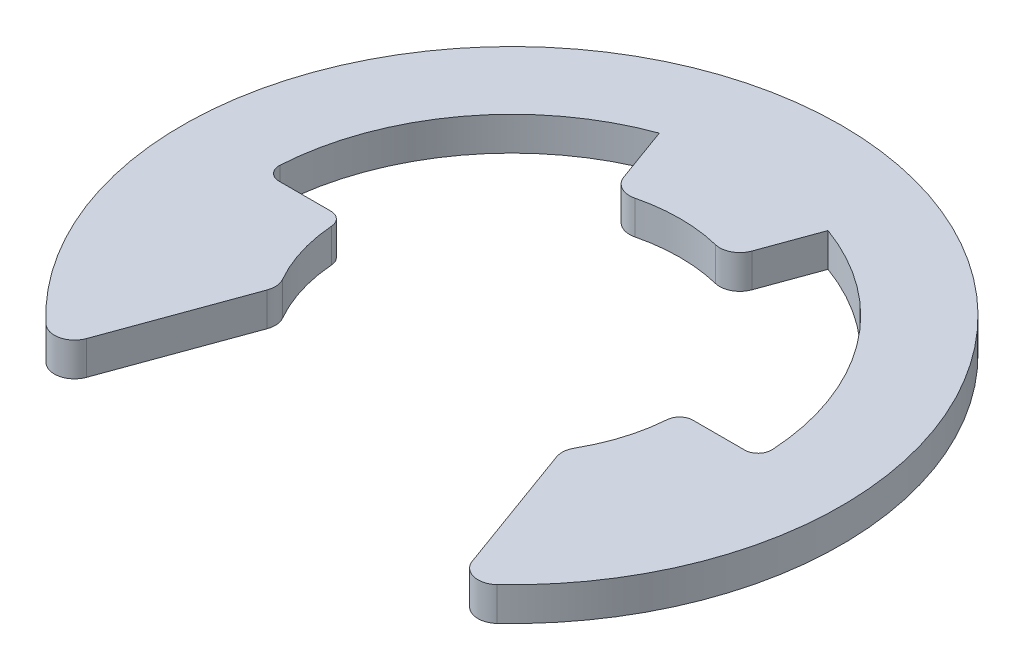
ISO-10303-21;
HEADER;
FILE_DESCRIPTION(('STEP AP214'),'2;1');
FILE_NAME('part.step','',(''),(''),'','','');
FILE_SCHEMA(('AUTOMOTIVE_DESIGN { 1 0 10303 214 1 1 1 1 }'));
ENDSEC;
DATA;
#1=APPLICATION_CONTEXT('core data for automotive mechanical design processes');
#2=APPLICATION_PROTOCOL_DEFINITION('international standard','automotive_design',2000,#1);
#3=PRODUCT_CONTEXT('',#1,'mechanical');
#4=PRODUCT('Part','Part','',(#3));
#5=PRODUCT_RELATED_PRODUCT_CATEGORY('part','',(#4));
#6=PRODUCT_DEFINITION_FORMATION('','',#4);
#7=PRODUCT_DEFINITION_CONTEXT('part definition',#1,'design');
#8=PRODUCT_DEFINITION('design','',#6,#7);
#9=PRODUCT_DEFINITION_SHAPE('','',#8);
#10=(LENGTH_UNIT() NAMED_UNIT(*) SI_UNIT(.MILLI.,.METRE.));
#11=(NAMED_UNIT(*) PLANE_ANGLE_UNIT() SI_UNIT($,.RADIAN.));
#12=(NAMED_UNIT(*) SI_UNIT($,.STERADIAN.) SOLID_ANGLE_UNIT());
#13=UNCERTAINTY_MEASURE_WITH_UNIT(LENGTH_MEASURE(1.E-05),#10,'distance_accuracy_value','');
#14=(GEOMETRIC_REPRESENTATION_CONTEXT(3) GLOBAL_UNCERTAINTY_ASSIGNED_CONTEXT((#13)) GLOBAL_UNIT_ASSIGNED_CONTEXT((#10,
#11,#12)) REPRESENTATION_CONTEXT('',''));
#15=CARTESIAN_POINT('',(0.,0.,0.));
#16=DIRECTION('',(0.,0.,1.));
#17=DIRECTION('',(1.,0.,0.));
#18=AXIS2_PLACEMENT_3D('',#15,#16,#17);
#19=CARTESIAN_POINT('',(0.,0.75,0.));
#20=DIRECTION('',(0.,-1.,0.));
#21=DIRECTION('',(0.,0.,-1.));
#22=AXIS2_PLACEMENT_3D('',#19,#20,#21);
#23=CYLINDRICAL_SURFACE('',#22,11.);
#24=CARTESIAN_POINT('',(0.,0.75,0.));
#25=DIRECTION('',(0.,-1.,0.));
#26=DIRECTION('',(0.,0.,1.));
#27=AXIS2_PLACEMENT_3D('',#24,#25,#26);
#28=CIRCLE('',#27,11.);
#29=CARTESIAN_POINT('',(-10.9816785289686,0.75,-0.634615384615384));
#30=VERTEX_POINT('',#29);
#31=CARTESIAN_POINT('',(-3.76222157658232,0.75,-10.336618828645));
#32=VERTEX_POINT('',#31);
#33=EDGE_CURVE('E187',#30,#32,#28,.T.);
#34=ORIENTED_EDGE('',*,*,#33,.F.);
#35=DIRECTION('',(0.,-1.,0.));
#36=VECTOR('',#35,1.);
#37=CARTESIAN_POINT('',(-10.9816785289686,0.75,-0.634615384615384));
#38=LINE('',#37,#36);
#39=CARTESIAN_POINT('',(-10.9816785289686,-0.75,-0.634615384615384));
#40=VERTEX_POINT('',#39);
#41=EDGE_CURVE('E328',#30,#40,#38,.T.);
#42=ORIENTED_EDGE('',*,*,#41,.T.);
#43=CARTESIAN_POINT('',(0.,-0.75,0.));
#44=DIRECTION('',(0.,-1.,0.));
#45=DIRECTION('',(0.,0.,1.));
#46=AXIS2_PLACEMENT_3D('',#43,#44,#45);
#47=CIRCLE('',#46,11.);
#48=CARTESIAN_POINT('',(-3.76222157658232,-0.75,-10.336618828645));
#49=VERTEX_POINT('',#48);
#50=EDGE_CURVE('E211',#40,#49,#47,.T.);
#51=ORIENTED_EDGE('',*,*,#50,.T.);
#52=DIRECTION('',(0.,-1.,0.));
#53=VECTOR('',#52,1.);
#54=CARTESIAN_POINT('',(-3.76222157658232,0.75,-10.336618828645));
#55=LINE('',#54,#53);
#56=EDGE_CURVE('E204',#32,#49,#55,.T.);
#57=ORIENTED_EDGE('',*,*,#56,.F.);
#58=EDGE_LOOP('',(#34,#42,#51,#57));
#59=FACE_BOUND('',#58,.T.);
#60=ADVANCED_FACE('F39',(#59),#23,.F.);
#61=CARTESIAN_POINT('',(-3.76222157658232,0.75,-10.336618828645));
#62=DIRECTION('',(0.939692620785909,0.,-0.342020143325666));
#63=DIRECTION('',(-0.342020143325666,0.,-0.939692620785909));
#64=AXIS2_PLACEMENT_3D('',#61,#62,#63);
#65=PLANE('',#64);
#66=DIRECTION('',(0.342020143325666,0.,0.939692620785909));
#67=VECTOR('',#66,1.);
#68=CARTESIAN_POINT('',(-3.76222157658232,-0.75,-10.336618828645));
#69=LINE('',#68,#67);
#70=CARTESIAN_POINT('',(-2.85643134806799,-0.75,-7.8479806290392));
#71=VERTEX_POINT('',#70);
#72=EDGE_CURVE('E449',#49,#71,#69,.T.);
#73=ORIENTED_EDGE('',*,*,#72,.T.);
#74=DIRECTION('',(0.,-1.,0.));
#75=VECTOR('',#74,1.);
#76=CARTESIAN_POINT('',(-2.85643134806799,0.75,-7.8479806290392));
#77=LINE('',#76,#75);
#78=CARTESIAN_POINT('',(-2.85643134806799,0.75,-7.8479806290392));
#79=VERTEX_POINT('',#78);
#80=EDGE_CURVE('E206',#71,#79,#77,.F.);
#81=ORIENTED_EDGE('',*,*,#80,.T.);
#82=DIRECTION('',(0.342020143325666,0.,0.939692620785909));
#83=VECTOR('',#82,1.);
#84=CARTESIAN_POINT('',(-3.76222157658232,0.75,-10.336618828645));
#85=LINE('',#84,#83);
#86=EDGE_CURVE('E191',#32,#79,#85,.T.);
#87=ORIENTED_EDGE('',*,*,#86,.F.);
#88=ORIENTED_EDGE('',*,*,#56,.T.);
#89=EDGE_LOOP('',(#73,#81,#87,#88));
#90=FACE_BOUND('',#89,.T.);
#91=ADVANCED_FACE('F203',(#90),#65,.F.);
#92=CARTESIAN_POINT('',(0.,0.75,0.));
#93=DIRECTION('',(0.,-1.,0.));
#94=DIRECTION('',(0.,0.,-1.));
#95=AXIS2_PLACEMENT_3D('',#92,#93,#94);
#96=CYLINDRICAL_SURFACE('',#95,7.5);
#97=CARTESIAN_POINT('',(0.,-0.75,0.));
#98=DIRECTION('',(0.,-1.,0.));
#99=DIRECTION('',(0.,0.,1.));
#100=AXIS2_PLACEMENT_3D('',#97,#98,#99);
#101=CIRCLE('',#100,7.5);
#102=CARTESIAN_POINT('',(-1.7952749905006,-0.75,-7.28196317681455));
#103=VERTEX_POINT('',#102);
#104=CARTESIAN_POINT('',(1.7952749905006,-0.75,-7.28196317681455));
#105=VERTEX_POINT('',#104);
#106=EDGE_CURVE('E451',#103,#105,#101,.T.);
#107=ORIENTED_EDGE('',*,*,#106,.T.);
#108=DIRECTION('',(0.,-1.,0.));
#109=VECTOR('',#108,1.);
#110=CARTESIAN_POINT('',(1.7952749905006,0.75,-7.28196317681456));
#111=LINE('',#110,#109);
#112=CARTESIAN_POINT('',(1.7952749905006,0.75,-7.28196317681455));
#113=VERTEX_POINT('',#112);
#114=EDGE_CURVE('E290',#105,#113,#111,.F.);
#115=ORIENTED_EDGE('',*,*,#114,.T.);
#116=CARTESIAN_POINT('',(0.,0.75,0.));
#117=DIRECTION('',(0.,-1.,0.));
#118=DIRECTION('',(0.,0.,1.));
#119=AXIS2_PLACEMENT_3D('',#116,#117,#118);
#120=CIRCLE('',#119,7.5);
#121=CARTESIAN_POINT('',(-1.7952749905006,0.75,-7.28196317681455));
#122=VERTEX_POINT('',#121);
#123=EDGE_CURVE('E208',#122,#113,#120,.T.);
#124=ORIENTED_EDGE('',*,*,#123,.F.);
#125=DIRECTION('',(0.,-1.,0.));
#126=VECTOR('',#125,1.);
#127=CARTESIAN_POINT('',(-1.7952749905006,0.75,-7.28196317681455));
#128=LINE('',#127,#126);
#129=EDGE_CURVE('E286',#122,#103,#128,.T.);
#130=ORIENTED_EDGE('',*,*,#129,.T.);
#131=EDGE_LOOP('',(#107,#115,#124,#130));
#132=FACE_BOUND('',#131,.T.);
#133=ADVANCED_FACE('F372',(#132),#96,.F.);
#134=CARTESIAN_POINT('',(2.56515107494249,0.75,-7.04769465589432));
#135=DIRECTION('',(-0.93969262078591,0.,-0.342020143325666));
#136=DIRECTION('',(-0.342020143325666,0.,0.93969262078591));
#137=AXIS2_PLACEMENT_3D('',#134,#135,#136);
#138=PLANE('',#137);
#139=DIRECTION('',(0.342020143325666,0.,-0.93969262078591));
#140=VECTOR('',#139,1.);
#141=CARTESIAN_POINT('',(2.56515107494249,0.75,-7.04769465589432));
#142=LINE('',#141,#140);
#143=CARTESIAN_POINT('',(2.85643134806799,0.75,-7.8479806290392));
#144=VERTEX_POINT('',#143);
#145=CARTESIAN_POINT('',(3.76222157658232,0.75,-10.336618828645));
#146=VERTEX_POINT('',#145);
#147=EDGE_CURVE('E426',#144,#146,#142,.T.);
#148=ORIENTED_EDGE('',*,*,#147,.F.);
#149=DIRECTION('',(0.,-1.,0.));
#150=VECTOR('',#149,1.);
#151=CARTESIAN_POINT('',(2.85643134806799,0.75,-7.8479806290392));
#152=LINE('',#151,#150);
#153=CARTESIAN_POINT('',(2.85643134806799,-0.75,-7.8479806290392));
#154=VERTEX_POINT('',#153);
#155=EDGE_CURVE('E282',#144,#154,#152,.T.);
#156=ORIENTED_EDGE('',*,*,#155,.T.);
#157=DIRECTION('',(0.342020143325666,0.,-0.93969262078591));
#158=VECTOR('',#157,1.);
#159=CARTESIAN_POINT('',(2.56515107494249,-0.75,-7.04769465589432));
#160=LINE('',#159,#158);
#161=CARTESIAN_POINT('',(3.76222157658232,-0.75,-10.336618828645));
#162=VERTEX_POINT('',#161);
#163=EDGE_CURVE('E454',#154,#162,#160,.T.);
#164=ORIENTED_EDGE('',*,*,#163,.T.);
#165=DIRECTION('',(0.,-1.,0.));
#166=VECTOR('',#165,1.);
#167=CARTESIAN_POINT('',(3.76222157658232,0.75,-10.336618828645));
#168=LINE('',#167,#166);
#169=EDGE_CURVE('E215',#146,#162,#168,.T.);
#170=ORIENTED_EDGE('',*,*,#169,.F.);
#171=EDGE_LOOP('',(#148,#156,#164,#170));
#172=FACE_BOUND('',#171,.T.);
#173=ADVANCED_FACE('F528',(#172),#138,.F.);
#174=CARTESIAN_POINT('',(0.,0.75,0.));
#175=DIRECTION('',(0.,-1.,0.));
#176=DIRECTION('',(0.,0.,-1.));
#177=AXIS2_PLACEMENT_3D('',#174,#175,#176);
#178=CYLINDRICAL_SURFACE('',#177,11.);
#179=CARTESIAN_POINT('',(0.,-0.75,0.));
#180=DIRECTION('',(0.,-1.,0.));
#181=DIRECTION('',(0.,0.,1.));
#182=AXIS2_PLACEMENT_3D('',#179,#180,#181);
#183=CIRCLE('',#182,11.);
#184=CARTESIAN_POINT('',(10.9816785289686,-0.75,-0.634615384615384));
#185=VERTEX_POINT('',#184);
#186=EDGE_CURVE('E457',#162,#185,#183,.T.);
#187=ORIENTED_EDGE('',*,*,#186,.T.);
#188=DIRECTION('',(0.,-1.,0.));
#189=VECTOR('',#188,1.);
#190=CARTESIAN_POINT('',(10.9816785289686,0.75,-0.634615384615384));
#191=LINE('',#190,#189);
#192=CARTESIAN_POINT('',(10.9816785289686,0.75,-0.634615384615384));
#193=VERTEX_POINT('',#192);
#194=EDGE_CURVE('E309',#185,#193,#191,.F.);
#195=ORIENTED_EDGE('',*,*,#194,.T.);
#196=CARTESIAN_POINT('',(0.,0.75,0.));
#197=DIRECTION('',(0.,-1.,0.));
#198=DIRECTION('',(0.,0.,1.));
#199=AXIS2_PLACEMENT_3D('',#196,#197,#198);
#200=CIRCLE('',#199,11.);
#201=EDGE_CURVE('E412',#146,#193,#200,.T.);
#202=ORIENTED_EDGE('',*,*,#201,.F.);
#203=ORIENTED_EDGE('',*,*,#169,.T.);
#204=EDGE_LOOP('',(#187,#195,#202,#203));
#205=FACE_BOUND('',#204,.T.);
#206=ADVANCED_FACE('F522',(#205),#178,.F.);
#207=CARTESIAN_POINT('',(7.5,0.75,0.));
#208=DIRECTION('',(0.,0.,1.));
#209=DIRECTION('',(1.,0.,0.));
#210=AXIS2_PLACEMENT_3D('',#207,#208,#209);
#211=PLANE('',#210);
#212=DIRECTION('',(-1.,0.,0.));
#213=VECTOR('',#212,1.);
#214=CARTESIAN_POINT('',(7.5,0.75,0.));
#215=LINE('',#214,#213);
#216=CARTESIAN_POINT('',(10.3826778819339,0.75,0.));
#217=VERTEX_POINT('',#216);
#218=CARTESIAN_POINT('',(8.07774721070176,0.75,0.));
#219=VERTEX_POINT('',#218);
#220=EDGE_CURVE('E409',#217,#219,#215,.T.);
#221=ORIENTED_EDGE('',*,*,#220,.F.);
#222=DIRECTION('',(0.,1.,0.));
#223=VECTOR('',#222,1.);
#224=CARTESIAN_POINT('',(10.3826778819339,-0.75,0.));
#225=LINE('',#224,#223);
#226=CARTESIAN_POINT('',(10.3826778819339,-0.75,0.));
#227=VERTEX_POINT('',#226);
#228=EDGE_CURVE('E305',#217,#227,#225,.F.);
#229=ORIENTED_EDGE('',*,*,#228,.T.);
#230=DIRECTION('',(-1.,0.,0.));
#231=VECTOR('',#230,1.);
#232=CARTESIAN_POINT('',(7.5,-0.75,0.));
#233=LINE('',#232,#231);
#234=CARTESIAN_POINT('',(8.07774721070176,-0.75,0.));
#235=VERTEX_POINT('',#234);
#236=EDGE_CURVE('E461',#227,#235,#233,.T.);
#237=ORIENTED_EDGE('',*,*,#236,.T.);
#238=DIRECTION('',(0.,-1.,0.));
#239=VECTOR('',#238,1.);
#240=CARTESIAN_POINT('',(8.07774721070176,0.75,0.));
#241=LINE('',#240,#239);
#242=EDGE_CURVE('E302',#235,#219,#241,.F.);
#243=ORIENTED_EDGE('',*,*,#242,.T.);
#244=EDGE_LOOP('',(#221,#229,#237,#243));
#245=FACE_BOUND('',#244,.T.);
#246=ADVANCED_FACE('F414',(#245),#211,.F.);
#247=CARTESIAN_POINT('',(0.,0.75,0.));
#248=DIRECTION('',(0.,-1.,0.));
#249=DIRECTION('',(0.,0.,-1.));
#250=AXIS2_PLACEMENT_3D('',#247,#248,#249);
#251=CYLINDRICAL_SURFACE('',#250,7.5);
#252=CARTESIAN_POINT('',(0.,0.75,0.));
#253=DIRECTION('',(0.,-1.,0.));
#254=DIRECTION('',(0.,0.,1.));
#255=AXIS2_PLACEMENT_3D('',#252,#253,#254);
#256=CIRCLE('',#255,7.5);
#257=CARTESIAN_POINT('',(7.47939556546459,0.75,0.555555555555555));
#258=VERTEX_POINT('',#257);
#259=CARTESIAN_POINT('',(6.5162225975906,0.75,3.71333314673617));
#260=VERTEX_POINT('',#259);
#261=EDGE_CURVE('E419',#258,#260,#256,.T.);
#262=ORIENTED_EDGE('',*,*,#261,.F.);
#263=DIRECTION('',(0.,-1.,0.));
#264=VECTOR('',#263,1.);
#265=CARTESIAN_POINT('',(7.47939556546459,0.75,0.555555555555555));
#266=LINE('',#265,#264);
#267=CARTESIAN_POINT('',(7.47939556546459,-0.75,0.555555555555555));
#268=VERTEX_POINT('',#267);
#269=EDGE_CURVE('E312',#258,#268,#266,.T.);
#270=ORIENTED_EDGE('',*,*,#269,.T.);
#271=CARTESIAN_POINT('',(0.,-0.75,0.));
#272=DIRECTION('',(0.,-1.,0.));
#273=DIRECTION('',(0.,0.,1.));
#274=AXIS2_PLACEMENT_3D('',#271,#272,#273);
#275=CIRCLE('',#274,7.5);
#276=CARTESIAN_POINT('',(6.5162225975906,-0.75,3.71333314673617));
#277=VERTEX_POINT('',#276);
#278=EDGE_CURVE('E464',#268,#277,#275,.T.);
#279=ORIENTED_EDGE('',*,*,#278,.T.);
#280=DIRECTION('',(0.,-1.,0.));
#281=VECTOR('',#280,1.);
#282=CARTESIAN_POINT('',(6.51622259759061,0.75,3.71333314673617));
#283=LINE('',#282,#281);
#284=EDGE_CURVE('E249',#277,#260,#283,.F.);
#285=ORIENTED_EDGE('',*,*,#284,.T.);
#286=EDGE_LOOP('',(#262,#270,#279,#285));
#287=FACE_BOUND('',#286,.T.);
#288=ADVANCED_FACE('F513',(#287),#251,.F.);
#289=CARTESIAN_POINT('',(6.30499999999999,0.75,4.0616468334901));
#290=DIRECTION('',(0.939692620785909,0.,-0.342020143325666));
#291=DIRECTION('',(-0.342020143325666,0.,-0.939692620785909));
#292=AXIS2_PLACEMENT_3D('',#289,#290,#291);
#293=PLANE('',#292);
#294=DIRECTION('',(0.342020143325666,0.,0.939692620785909));
#295=VECTOR('',#294,1.);
#296=CARTESIAN_POINT('',(6.30499999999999,0.75,4.0616468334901));
#297=LINE('',#296,#295);
#298=CARTESIAN_POINT('',(6.45244595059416,0.75,4.46675125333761));
#299=VERTEX_POINT('',#298);
#300=CARTESIAN_POINT('',(8.60039109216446,0.75,10.3681820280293));
#301=VERTEX_POINT('',#300);
#302=EDGE_CURVE('E423',#299,#301,#297,.T.);
#303=ORIENTED_EDGE('',*,*,#302,.F.);
#304=DIRECTION('',(0.,-1.,0.));
#305=VECTOR('',#304,1.);
#306=CARTESIAN_POINT('',(6.45244595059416,0.75,4.46675125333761));
#307=LINE('',#306,#305);
#308=CARTESIAN_POINT('',(6.45244595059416,-0.75,4.46675125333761));
#309=VERTEX_POINT('',#308);
#310=EDGE_CURVE('E220',#299,#309,#307,.T.);
#311=ORIENTED_EDGE('',*,*,#310,.T.);
#312=DIRECTION('',(0.342020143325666,0.,0.939692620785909));
#313=VECTOR('',#312,1.);
#314=CARTESIAN_POINT('',(6.30499999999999,-0.75,4.0616468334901));
#315=LINE('',#314,#313);
#316=CARTESIAN_POINT('',(8.60039109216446,-0.75,10.3681820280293));
#317=VERTEX_POINT('',#316);
#318=EDGE_CURVE('E467',#309,#317,#315,.T.);
#319=ORIENTED_EDGE('',*,*,#318,.T.);
#320=DIRECTION('',(0.,-1.,0.));
#321=VECTOR('',#320,1.);
#322=CARTESIAN_POINT('',(8.60039109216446,0.75,10.3681820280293));
#323=LINE('',#322,#321);
#324=EDGE_CURVE('E214',#317,#301,#323,.F.);
#325=ORIENTED_EDGE('',*,*,#324,.T.);
#326=EDGE_LOOP('',(#303,#311,#319,#325));
#327=FACE_BOUND('',#326,.T.);
#328=ADVANCED_FACE('F507',(#327),#293,.F.);
#329=CARTESIAN_POINT('',(0.,0.75,0.));
#330=DIRECTION('',(0.,-1.,0.));
#331=DIRECTION('',(0.,0.,-1.));
#332=AXIS2_PLACEMENT_3D('',#329,#330,#331);
#333=CYLINDRICAL_SURFACE('',#332,14.7);
#334=CARTESIAN_POINT('',(0.,0.75,0.));
#335=DIRECTION('',(0.,1.,0.));
#336=DIRECTION('',(0.,0.,1.));
#337=AXIS2_PLACEMENT_3D('',#334,#335,#336);
#338=CIRCLE('',#337,14.7);
#339=CARTESIAN_POINT('',(10.0621653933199,0.75,10.7164745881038));
#340=VERTEX_POINT('',#339);
#341=CARTESIAN_POINT('',(-10.06216539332,0.75,10.7164745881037));
#342=VERTEX_POINT('',#341);
#343=EDGE_CURVE('E433',#340,#342,#338,.T.);
#344=ORIENTED_EDGE('',*,*,#343,.F.);
#345=DIRECTION('',(0.,-1.,0.));
#346=VECTOR('',#345,1.);
#347=CARTESIAN_POINT('',(10.0621653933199,0.75,10.7164745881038));
#348=LINE('',#347,#346);
#349=CARTESIAN_POINT('',(10.0621653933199,-0.75,10.7164745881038));
#350=VERTEX_POINT('',#349);
#351=EDGE_CURVE('E298',#340,#350,#348,.T.);
#352=ORIENTED_EDGE('',*,*,#351,.T.);
#353=CARTESIAN_POINT('',(0.,-0.75,0.));
#354=DIRECTION('',(0.,1.,0.));
#355=DIRECTION('',(0.,0.,1.));
#356=AXIS2_PLACEMENT_3D('',#353,#354,#355);
#357=CIRCLE('',#356,14.7);
#358=CARTESIAN_POINT('',(-10.06216539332,-0.75,10.7164745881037));
#359=VERTEX_POINT('',#358);
#360=EDGE_CURVE('E471',#350,#359,#357,.T.);
#361=ORIENTED_EDGE('',*,*,#360,.T.);
#362=DIRECTION('',(0.,-1.,0.));
#363=VECTOR('',#362,1.);
#364=CARTESIAN_POINT('',(-10.06216539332,0.75,10.7164745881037));
#365=LINE('',#364,#363);
#366=EDGE_CURVE('E295',#359,#342,#365,.F.);
#367=ORIENTED_EDGE('',*,*,#366,.T.);
#368=EDGE_LOOP('',(#344,#352,#361,#367));
#369=FACE_BOUND('',#368,.T.);
#370=ADVANCED_FACE('F500',(#369),#333,.T.);
#371=CARTESIAN_POINT('',(-9.04446213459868,0.75,11.5882571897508));
#372=DIRECTION('',(-0.939692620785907,0.,-0.342020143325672));
#373=DIRECTION('',(-0.342020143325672,0.,0.939692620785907));
#374=AXIS2_PLACEMENT_3D('',#371,#372,#373);
#375=PLANE('',#374);
#376=DIRECTION('',(0.342020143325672,0.,-0.939692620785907));
#377=VECTOR('',#376,1.);
#378=CARTESIAN_POINT('',(-9.04446213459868,-0.75,11.5882571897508));
#379=LINE('',#378,#377);
#380=CARTESIAN_POINT('',(-8.60039109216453,-0.75,10.3681820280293));
#381=VERTEX_POINT('',#380);
#382=CARTESIAN_POINT('',(-6.45244595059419,-0.75,4.46675125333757));
#383=VERTEX_POINT('',#382);
#384=EDGE_CURVE('E475',#381,#383,#379,.T.);
#385=ORIENTED_EDGE('',*,*,#384,.T.);
#386=DIRECTION('',(0.,-1.,0.));
#387=VECTOR('',#386,1.);
#388=CARTESIAN_POINT('',(-6.45244595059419,0.75,4.46675125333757));
#389=LINE('',#388,#387);
#390=CARTESIAN_POINT('',(-6.45244595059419,0.75,4.46675125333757));
#391=VERTEX_POINT('',#390);
#392=EDGE_CURVE('E279',#383,#391,#389,.F.);
#393=ORIENTED_EDGE('',*,*,#392,.T.);
#394=DIRECTION('',(0.342020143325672,0.,-0.939692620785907));
#395=VECTOR('',#394,1.);
#396=CARTESIAN_POINT('',(-9.04446213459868,0.75,11.5882571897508));
#397=LINE('',#396,#395);
#398=CARTESIAN_POINT('',(-8.60039109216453,0.75,10.3681820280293));
#399=VERTEX_POINT('',#398);
#400=EDGE_CURVE('E437',#399,#391,#397,.T.);
#401=ORIENTED_EDGE('',*,*,#400,.F.);
#402=DIRECTION('',(0.,-1.,0.));
#403=VECTOR('',#402,1.);
#404=CARTESIAN_POINT('',(-8.60039109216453,0.75,10.3681820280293));
#405=LINE('',#404,#403);
#406=EDGE_CURVE('E275',#399,#381,#405,.T.);
#407=ORIENTED_EDGE('',*,*,#406,.T.);
#408=EDGE_LOOP('',(#385,#393,#401,#407));
#409=FACE_BOUND('',#408,.T.);
#410=ADVANCED_FACE('F492',(#409),#375,.F.);
#411=CARTESIAN_POINT('',(0.,0.75,0.));
#412=DIRECTION('',(0.,-1.,0.));
#413=DIRECTION('',(0.,0.,-1.));
#414=AXIS2_PLACEMENT_3D('',#411,#412,#413);
#415=CYLINDRICAL_SURFACE('',#414,7.5);
#416=CARTESIAN_POINT('',(0.,-0.75,0.));
#417=DIRECTION('',(0.,-1.,0.));
#418=DIRECTION('',(0.,0.,1.));
#419=AXIS2_PLACEMENT_3D('',#416,#417,#418);
#420=CIRCLE('',#419,7.5);
#421=CARTESIAN_POINT('',(-6.51622259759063,-0.75,3.71333314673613));
#422=VERTEX_POINT('',#421);
#423=CARTESIAN_POINT('',(-7.47939556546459,-0.75,0.555555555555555));
#424=VERTEX_POINT('',#423);
#425=EDGE_CURVE('E355',#422,#424,#420,.T.);
#426=ORIENTED_EDGE('',*,*,#425,.T.);
#427=DIRECTION('',(0.,-1.,0.));
#428=VECTOR('',#427,1.);
#429=CARTESIAN_POINT('',(-7.47939556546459,0.75,0.555555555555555));
#430=LINE('',#429,#428);
#431=CARTESIAN_POINT('',(-7.47939556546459,0.75,0.555555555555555));
#432=VERTEX_POINT('',#431);
#433=EDGE_CURVE('E337',#424,#432,#430,.F.);
#434=ORIENTED_EDGE('',*,*,#433,.T.);
#435=CARTESIAN_POINT('',(0.,0.75,0.));
#436=DIRECTION('',(0.,-1.,0.));
#437=DIRECTION('',(0.,0.,1.));
#438=AXIS2_PLACEMENT_3D('',#435,#436,#437);
#439=CIRCLE('',#438,7.5);
#440=CARTESIAN_POINT('',(-6.51622259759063,0.75,3.71333314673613));
#441=VERTEX_POINT('',#440);
#442=EDGE_CURVE('E441',#441,#432,#439,.T.);
#443=ORIENTED_EDGE('',*,*,#442,.F.);
#444=DIRECTION('',(0.,-1.,0.));
#445=VECTOR('',#444,1.);
#446=CARTESIAN_POINT('',(-6.51622259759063,0.75,3.71333314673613));
#447=LINE('',#446,#445);
#448=EDGE_CURVE('E271',#441,#422,#447,.T.);
#449=ORIENTED_EDGE('',*,*,#448,.T.);
#450=EDGE_LOOP('',(#426,#434,#443,#449));
#451=FACE_BOUND('',#450,.T.);
#452=ADVANCED_FACE('F484',(#451),#415,.F.);
#453=CARTESIAN_POINT('',(-7.5,0.75,0.));
#454=DIRECTION('',(0.,0.,1.));
#455=DIRECTION('',(1.,0.,0.));
#456=AXIS2_PLACEMENT_3D('',#453,#454,#455);
#457=PLANE('',#456);
#458=DIRECTION('',(-1.,0.,0.));
#459=VECTOR('',#458,1.);
#460=CARTESIAN_POINT('',(-7.5,-0.75,0.));
#461=LINE('',#460,#459);
#462=CARTESIAN_POINT('',(-8.07774721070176,-0.75,0.));
#463=VERTEX_POINT('',#462);
#464=CARTESIAN_POINT('',(-10.3826778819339,-0.75,0.));
#465=VERTEX_POINT('',#464);
#466=EDGE_CURVE('E198',#463,#465,#461,.T.);
#467=ORIENTED_EDGE('',*,*,#466,.T.);
#468=DIRECTION('',(0.,1.,0.));
#469=VECTOR('',#468,1.);
#470=CARTESIAN_POINT('',(-10.3826778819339,0.75,0.));
#471=LINE('',#470,#469);
#472=CARTESIAN_POINT('',(-10.3826778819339,0.75,0.));
#473=VERTEX_POINT('',#472);
#474=EDGE_CURVE('E61',#465,#473,#471,.T.);
#475=ORIENTED_EDGE('',*,*,#474,.T.);
#476=DIRECTION('',(-1.,0.,0.));
#477=VECTOR('',#476,1.);
#478=CARTESIAN_POINT('',(-7.5,0.75,0.));
#479=LINE('',#478,#477);
#480=CARTESIAN_POINT('',(-8.07774721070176,0.75,0.));
#481=VERTEX_POINT('',#480);
#482=EDGE_CURVE('E224',#481,#473,#479,.T.);
#483=ORIENTED_EDGE('',*,*,#482,.F.);
#484=DIRECTION('',(0.,-1.,0.));
#485=VECTOR('',#484,1.);
#486=CARTESIAN_POINT('',(-8.07774721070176,0.75,0.));
#487=LINE('',#486,#485);
#488=EDGE_CURVE('E331',#481,#463,#487,.T.);
#489=ORIENTED_EDGE('',*,*,#488,.T.);
#490=EDGE_LOOP('',(#467,#475,#483,#489));
#491=FACE_BOUND('',#490,.T.);
#492=ADVANCED_FACE('F352',(#491),#457,.F.);
#493=CARTESIAN_POINT('',(0.,0.75,0.));
#494=DIRECTION('',(0.,1.,0.));
#495=DIRECTION('',(0.,0.,1.));
#496=AXIS2_PLACEMENT_3D('',#493,#494,#495);
#497=PLANE('',#496);
#498=ORIENTED_EDGE('',*,*,#220,.T.);
#499=CARTESIAN_POINT('',(8.07774721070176,0.75,0.6));
#500=DIRECTION('',(0.,1.,0.));
#501=DIRECTION('',(0.,0.,1.));
#502=AXIS2_PLACEMENT_3D('',#499,#500,#501);
#503=CIRCLE('',#502,0.6);
#504=EDGE_CURVE('E325',#219,#258,#503,.T.);
#505=ORIENTED_EDGE('',*,*,#504,.T.);
#506=ORIENTED_EDGE('',*,*,#261,.T.);
#507=CARTESIAN_POINT('',(7.29816930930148,0.75,4.15893312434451));
#508=DIRECTION('',(0.,1.,0.));
#509=DIRECTION('',(0.,0.,1.));
#510=AXIS2_PLACEMENT_3D('',#507,#508,#509);
#511=CIRCLE('',#510,0.9);
#512=EDGE_CURVE('E268',#260,#299,#511,.T.);
#513=ORIENTED_EDGE('',*,*,#512,.T.);
#514=ORIENTED_EDGE('',*,*,#302,.T.);
#515=CARTESIAN_POINT('',(9.44611445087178,0.75,10.0603638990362));
#516=DIRECTION('',(0.,1.,0.));
#517=DIRECTION('',(0.,0.,1.));
#518=AXIS2_PLACEMENT_3D('',#515,#516,#517);
#519=CIRCLE('',#518,0.9);
#520=EDGE_CURVE('E256',#301,#340,#519,.T.);
#521=ORIENTED_EDGE('',*,*,#520,.T.);
#522=ORIENTED_EDGE('',*,*,#343,.T.);
#523=CARTESIAN_POINT('',(-9.44611445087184,0.75,10.0603638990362));
#524=DIRECTION('',(0.,1.,0.));
#525=DIRECTION('',(0.,0.,1.));
#526=AXIS2_PLACEMENT_3D('',#523,#524,#525);
#527=CIRCLE('',#526,0.9);
#528=EDGE_CURVE('E253',#342,#399,#527,.T.);
#529=ORIENTED_EDGE('',*,*,#528,.T.);
#530=ORIENTED_EDGE('',*,*,#400,.T.);
#531=CARTESIAN_POINT('',(-7.2981693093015,0.75,4.15893312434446));
#532=DIRECTION('',(0.,1.,0.));
#533=DIRECTION('',(0.,0.,1.));
#534=AXIS2_PLACEMENT_3D('',#531,#532,#533);
#535=CIRCLE('',#534,0.9);
#536=EDGE_CURVE('E265',#391,#441,#535,.T.);
#537=ORIENTED_EDGE('',*,*,#536,.T.);
#538=ORIENTED_EDGE('',*,*,#442,.T.);
#539=CARTESIAN_POINT('',(-8.07774721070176,0.75,0.6));
#540=DIRECTION('',(0.,1.,0.));
#541=DIRECTION('',(0.,0.,1.));
#542=AXIS2_PLACEMENT_3D('',#539,#540,#541);
#543=CIRCLE('',#542,0.6);
#544=EDGE_CURVE('E322',#432,#481,#543,.T.);
#545=ORIENTED_EDGE('',*,*,#544,.T.);
#546=ORIENTED_EDGE('',*,*,#482,.T.);
#547=CARTESIAN_POINT('',(-10.3826778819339,0.75,-0.6));
#548=DIRECTION('',(0.,1.,0.));
#549=DIRECTION('',(0.,0.,1.));
#550=AXIS2_PLACEMENT_3D('',#547,#548,#549);
#551=CIRCLE('',#550,0.6);
#552=EDGE_CURVE('E11',#473,#30,#551,.F.);
#553=ORIENTED_EDGE('',*,*,#552,.T.);
#554=ORIENTED_EDGE('',*,*,#33,.T.);
#555=ORIENTED_EDGE('',*,*,#86,.T.);
#556=CARTESIAN_POINT('',(-2.01070798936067,0.75,-8.1557987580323));
#557=DIRECTION('',(0.,1.,0.));
#558=DIRECTION('',(0.,0.,1.));
#559=AXIS2_PLACEMENT_3D('',#556,#557,#558);
#560=CIRCLE('',#559,0.9);
#561=EDGE_CURVE('E259',#79,#122,#560,.T.);
#562=ORIENTED_EDGE('',*,*,#561,.T.);
#563=ORIENTED_EDGE('',*,*,#123,.T.);
#564=CARTESIAN_POINT('',(2.01070798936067,0.75,-8.1557987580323));
#565=DIRECTION('',(0.,1.,0.));
#566=DIRECTION('',(0.,0.,1.));
#567=AXIS2_PLACEMENT_3D('',#564,#565,#566);
#568=CIRCLE('',#567,0.9);
#569=EDGE_CURVE('E262',#113,#144,#568,.T.);
#570=ORIENTED_EDGE('',*,*,#569,.T.);
#571=ORIENTED_EDGE('',*,*,#147,.T.);
#572=ORIENTED_EDGE('',*,*,#201,.T.);
#573=CARTESIAN_POINT('',(10.3826778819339,0.75,-0.6));
#574=DIRECTION('',(0.,1.,0.));
#575=DIRECTION('',(0.,0.,1.));
#576=AXIS2_PLACEMENT_3D('',#573,#574,#575);
#577=CIRCLE('',#576,0.6);
#578=EDGE_CURVE('E343',#193,#217,#577,.F.);
#579=ORIENTED_EDGE('',*,*,#578,.T.);
#580=EDGE_LOOP('',(#498,#505,#506,#513,#514,#521,#522,#529,#530,#537,#538,#545,#546,#553,#554,
#555,#562,#563,#570,#571,#572,#579));
#581=FACE_BOUND('',#580,.T.);
#582=ADVANCED_FACE('F190',(#581),#497,.T.);
#583=CARTESIAN_POINT('',(0.,-0.75,0.));
#584=DIRECTION('',(0.,1.,0.));
#585=DIRECTION('',(0.,0.,1.));
#586=AXIS2_PLACEMENT_3D('',#583,#584,#585);
#587=PLANE('',#586);
#588=ORIENTED_EDGE('',*,*,#278,.F.);
#589=CARTESIAN_POINT('',(8.07774721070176,-0.75,0.6));
#590=DIRECTION('',(0.,1.,0.));
#591=DIRECTION('',(0.,0.,1.));
#592=AXIS2_PLACEMENT_3D('',#589,#590,#591);
#593=CIRCLE('',#592,0.6);
#594=EDGE_CURVE('E319',#268,#235,#593,.F.);
#595=ORIENTED_EDGE('',*,*,#594,.T.);
#596=ORIENTED_EDGE('',*,*,#236,.F.);
#597=CARTESIAN_POINT('',(10.3826778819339,-0.75,-0.6));
#598=DIRECTION('',(0.,1.,0.));
#599=DIRECTION('',(0.,0.,1.));
#600=AXIS2_PLACEMENT_3D('',#597,#598,#599);
#601=CIRCLE('',#600,0.6);
#602=EDGE_CURVE('E340',#227,#185,#601,.T.);
#603=ORIENTED_EDGE('',*,*,#602,.T.);
#604=ORIENTED_EDGE('',*,*,#186,.F.);
#605=ORIENTED_EDGE('',*,*,#163,.F.);
#606=CARTESIAN_POINT('',(2.01070798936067,-0.75,-8.1557987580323));
#607=DIRECTION('',(0.,1.,0.));
#608=DIRECTION('',(0.,0.,1.));
#609=AXIS2_PLACEMENT_3D('',#606,#607,#608);
#610=CIRCLE('',#609,0.9);
#611=EDGE_CURVE('E239',#154,#105,#610,.F.);
#612=ORIENTED_EDGE('',*,*,#611,.T.);
#613=ORIENTED_EDGE('',*,*,#106,.F.);
#614=CARTESIAN_POINT('',(-2.01070798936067,-0.75,-8.1557987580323));
#615=DIRECTION('',(0.,1.,0.));
#616=DIRECTION('',(0.,0.,1.));
#617=AXIS2_PLACEMENT_3D('',#614,#615,#616);
#618=CIRCLE('',#617,0.9);
#619=EDGE_CURVE('E236',#103,#71,#618,.F.);
#620=ORIENTED_EDGE('',*,*,#619,.T.);
#621=ORIENTED_EDGE('',*,*,#72,.F.);
#622=ORIENTED_EDGE('',*,*,#50,.F.);
#623=CARTESIAN_POINT('',(-10.3826778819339,-0.75,-0.6));
#624=DIRECTION('',(0.,1.,0.));
#625=DIRECTION('',(0.,0.,1.));
#626=AXIS2_PLACEMENT_3D('',#623,#624,#625);
#627=CIRCLE('',#626,0.6);
#628=EDGE_CURVE('E48',#40,#465,#627,.T.);
#629=ORIENTED_EDGE('',*,*,#628,.T.);
#630=ORIENTED_EDGE('',*,*,#466,.F.);
#631=CARTESIAN_POINT('',(-8.07774721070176,-0.75,0.6));
#632=DIRECTION('',(0.,1.,0.));
#633=DIRECTION('',(0.,0.,1.));
#634=AXIS2_PLACEMENT_3D('',#631,#632,#633);
#635=CIRCLE('',#634,0.6);
#636=EDGE_CURVE('E316',#463,#424,#635,.F.);
#637=ORIENTED_EDGE('',*,*,#636,.T.);
#638=ORIENTED_EDGE('',*,*,#425,.F.);
#639=CARTESIAN_POINT('',(-7.2981693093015,-0.75,4.15893312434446));
#640=DIRECTION('',(0.,1.,0.));
#641=DIRECTION('',(0.,0.,1.));
#642=AXIS2_PLACEMENT_3D('',#639,#640,#641);
#643=CIRCLE('',#642,0.9);
#644=EDGE_CURVE('E242',#422,#383,#643,.F.);
#645=ORIENTED_EDGE('',*,*,#644,.T.);
#646=ORIENTED_EDGE('',*,*,#384,.F.);
#647=CARTESIAN_POINT('',(-9.44611445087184,-0.75,10.0603638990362));
#648=DIRECTION('',(0.,1.,0.));
#649=DIRECTION('',(0.,0.,1.));
#650=AXIS2_PLACEMENT_3D('',#647,#648,#649);
#651=CIRCLE('',#650,0.9);
#652=EDGE_CURVE('E231',#381,#359,#651,.F.);
#653=ORIENTED_EDGE('',*,*,#652,.T.);
#654=ORIENTED_EDGE('',*,*,#360,.F.);
#655=CARTESIAN_POINT('',(9.44611445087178,-0.75,10.0603638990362));
#656=DIRECTION('',(0.,1.,0.));
#657=DIRECTION('',(0.,0.,1.));
#658=AXIS2_PLACEMENT_3D('',#655,#656,#657);
#659=CIRCLE('',#658,0.9);
#660=EDGE_CURVE('E233',#350,#317,#659,.F.);
#661=ORIENTED_EDGE('',*,*,#660,.T.);
#662=ORIENTED_EDGE('',*,*,#318,.F.);
#663=CARTESIAN_POINT('',(7.29816930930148,-0.75,4.15893312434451));
#664=DIRECTION('',(0.,1.,0.));
#665=DIRECTION('',(0.,0.,1.));
#666=AXIS2_PLACEMENT_3D('',#663,#664,#665);
#667=CIRCLE('',#666,0.9);
#668=EDGE_CURVE('E245',#309,#277,#667,.F.);
#669=ORIENTED_EDGE('',*,*,#668,.T.);
#670=EDGE_LOOP('',(#588,#595,#596,#603,#604,#605,#612,#613,#620,#621,#622,#629,#630,#637,#638,
#645,#646,#653,#654,#661,#662,#669));
#671=FACE_BOUND('',#670,.T.);
#672=ADVANCED_FACE('F350',(#671),#587,.F.);
#673=CARTESIAN_POINT('',(7.29816930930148,0.75,4.15893312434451));
#674=DIRECTION('',(0.,-1.,0.));
#675=DIRECTION('',(0.,0.,-1.));
#676=AXIS2_PLACEMENT_3D('',#673,#674,#675);
#677=CYLINDRICAL_SURFACE('',#676,0.9);
#678=ORIENTED_EDGE('',*,*,#512,.F.);
#679=ORIENTED_EDGE('',*,*,#284,.F.);
#680=ORIENTED_EDGE('',*,*,#668,.F.);
#681=ORIENTED_EDGE('',*,*,#310,.F.);
#682=EDGE_LOOP('',(#678,#679,#680,#681));
#683=FACE_BOUND('',#682,.T.);
#684=ADVANCED_FACE('F376',(#683),#677,.T.);
#685=CARTESIAN_POINT('',(-7.2981693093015,0.75,4.15893312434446));
#686=DIRECTION('',(0.,-1.,0.));
#687=DIRECTION('',(0.,0.,-1.));
#688=AXIS2_PLACEMENT_3D('',#685,#686,#687);
#689=CYLINDRICAL_SURFACE('',#688,0.9);
#690=ORIENTED_EDGE('',*,*,#536,.F.);
#691=ORIENTED_EDGE('',*,*,#392,.F.);
#692=ORIENTED_EDGE('',*,*,#644,.F.);
#693=ORIENTED_EDGE('',*,*,#448,.F.);
#694=EDGE_LOOP('',(#690,#691,#692,#693));
#695=FACE_BOUND('',#694,.T.);
#696=ADVANCED_FACE('F379',(#695),#689,.T.);
#697=CARTESIAN_POINT('',(2.01070798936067,0.75,-8.1557987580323));
#698=DIRECTION('',(0.,-1.,0.));
#699=DIRECTION('',(0.,0.,-1.));
#700=AXIS2_PLACEMENT_3D('',#697,#698,#699);
#701=CYLINDRICAL_SURFACE('',#700,0.9);
#702=ORIENTED_EDGE('',*,*,#569,.F.);
#703=ORIENTED_EDGE('',*,*,#114,.F.);
#704=ORIENTED_EDGE('',*,*,#611,.F.);
#705=ORIENTED_EDGE('',*,*,#155,.F.);
#706=EDGE_LOOP('',(#702,#703,#704,#705));
#707=FACE_BOUND('',#706,.T.);
#708=ADVANCED_FACE('F383',(#707),#701,.T.);
#709=CARTESIAN_POINT('',(-2.01070798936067,0.75,-8.1557987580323));
#710=DIRECTION('',(0.,-1.,0.));
#711=DIRECTION('',(0.,0.,-1.));
#712=AXIS2_PLACEMENT_3D('',#709,#710,#711);
#713=CYLINDRICAL_SURFACE('',#712,0.9);
#714=ORIENTED_EDGE('',*,*,#561,.F.);
#715=ORIENTED_EDGE('',*,*,#80,.F.);
#716=ORIENTED_EDGE('',*,*,#619,.F.);
#717=ORIENTED_EDGE('',*,*,#129,.F.);
#718=EDGE_LOOP('',(#714,#715,#716,#717));
#719=FACE_BOUND('',#718,.T.);
#720=ADVANCED_FACE('F387',(#719),#713,.T.);
#721=CARTESIAN_POINT('',(9.44611445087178,0.75,10.0603638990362));
#722=DIRECTION('',(0.,-1.,0.));
#723=DIRECTION('',(0.,0.,-1.));
#724=AXIS2_PLACEMENT_3D('',#721,#722,#723);
#725=CYLINDRICAL_SURFACE('',#724,0.9);
#726=ORIENTED_EDGE('',*,*,#520,.F.);
#727=ORIENTED_EDGE('',*,*,#324,.F.);
#728=ORIENTED_EDGE('',*,*,#660,.F.);
#729=ORIENTED_EDGE('',*,*,#351,.F.);
#730=EDGE_LOOP('',(#726,#727,#728,#729));
#731=FACE_BOUND('',#730,.T.);
#732=ADVANCED_FACE('F391',(#731),#725,.T.);
#733=CARTESIAN_POINT('',(-9.44611445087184,0.75,10.0603638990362));
#734=DIRECTION('',(0.,-1.,0.));
#735=DIRECTION('',(0.,0.,-1.));
#736=AXIS2_PLACEMENT_3D('',#733,#734,#735);
#737=CYLINDRICAL_SURFACE('',#736,0.9);
#738=ORIENTED_EDGE('',*,*,#528,.F.);
#739=ORIENTED_EDGE('',*,*,#366,.F.);
#740=ORIENTED_EDGE('',*,*,#652,.F.);
#741=ORIENTED_EDGE('',*,*,#406,.F.);
#742=EDGE_LOOP('',(#738,#739,#740,#741));
#743=FACE_BOUND('',#742,.T.);
#744=ADVANCED_FACE('F395',(#743),#737,.T.);
#745=CARTESIAN_POINT('',(10.3826778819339,0.75,-0.6));
#746=DIRECTION('',(0.,-1.,0.));
#747=DIRECTION('',(0.,0.,-1.));
#748=AXIS2_PLACEMENT_3D('',#745,#746,#747);
#749=CYLINDRICAL_SURFACE('',#748,0.6);
#750=ORIENTED_EDGE('',*,*,#578,.F.);
#751=ORIENTED_EDGE('',*,*,#194,.F.);
#752=ORIENTED_EDGE('',*,*,#602,.F.);
#753=ORIENTED_EDGE('',*,*,#228,.F.);
#754=EDGE_LOOP('',(#750,#751,#752,#753));
#755=FACE_BOUND('',#754,.T.);
#756=ADVANCED_FACE('F364',(#755),#749,.F.);
#757=CARTESIAN_POINT('',(8.07774721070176,0.75,0.6));
#758=DIRECTION('',(0.,-1.,0.));
#759=DIRECTION('',(0.,0.,-1.));
#760=AXIS2_PLACEMENT_3D('',#757,#758,#759);
#761=CYLINDRICAL_SURFACE('',#760,0.6);
#762=ORIENTED_EDGE('',*,*,#504,.F.);
#763=ORIENTED_EDGE('',*,*,#242,.F.);
#764=ORIENTED_EDGE('',*,*,#594,.F.);
#765=ORIENTED_EDGE('',*,*,#269,.F.);
#766=EDGE_LOOP('',(#762,#763,#764,#765));
#767=FACE_BOUND('',#766,.T.);
#768=ADVANCED_FACE('F358',(#767),#761,.T.);
#769=CARTESIAN_POINT('',(-10.3826778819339,0.75,-0.6));
#770=DIRECTION('',(0.,-1.,0.));
#771=DIRECTION('',(0.,0.,-1.));
#772=AXIS2_PLACEMENT_3D('',#769,#770,#771);
#773=CYLINDRICAL_SURFACE('',#772,0.6);
#774=ORIENTED_EDGE('',*,*,#552,.F.);
#775=ORIENTED_EDGE('',*,*,#474,.F.);
#776=ORIENTED_EDGE('',*,*,#628,.F.);
#777=ORIENTED_EDGE('',*,*,#41,.F.);
#778=EDGE_LOOP('',(#774,#775,#776,#777));
#779=FACE_BOUND('',#778,.T.);
#780=ADVANCED_FACE('F356',(#779),#773,.F.);
#781=CARTESIAN_POINT('',(-8.07774721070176,0.75,0.6));
#782=DIRECTION('',(0.,-1.,0.));
#783=DIRECTION('',(0.,0.,-1.));
#784=AXIS2_PLACEMENT_3D('',#781,#782,#783);
#785=CYLINDRICAL_SURFACE('',#784,0.6);
#786=ORIENTED_EDGE('',*,*,#544,.F.);
#787=ORIENTED_EDGE('',*,*,#433,.F.);
#788=ORIENTED_EDGE('',*,*,#636,.F.);
#789=ORIENTED_EDGE('',*,*,#488,.F.);
#790=EDGE_LOOP('',(#786,#787,#788,#789));
#791=FACE_BOUND('',#790,.T.);
#792=ADVANCED_FACE('F41',(#791),#785,.T.);
#793=CLOSED_SHELL('',(#60,#91,#133,#173,#206,#246,#288,#328,#370,#410,#452,#492,#582,#672,#684,
#696,#708,#720,#732,#744,#756,#768,#780,#792));
#794=MANIFOLD_SOLID_BREP('B2',#793);
#795=ADVANCED_BREP_SHAPE_REPRESENTATION('',(#18,#794),#14);
#796=SHAPE_DEFINITION_REPRESENTATION(#9,#795);
ENDSEC;
END-ISO-10303-21;
